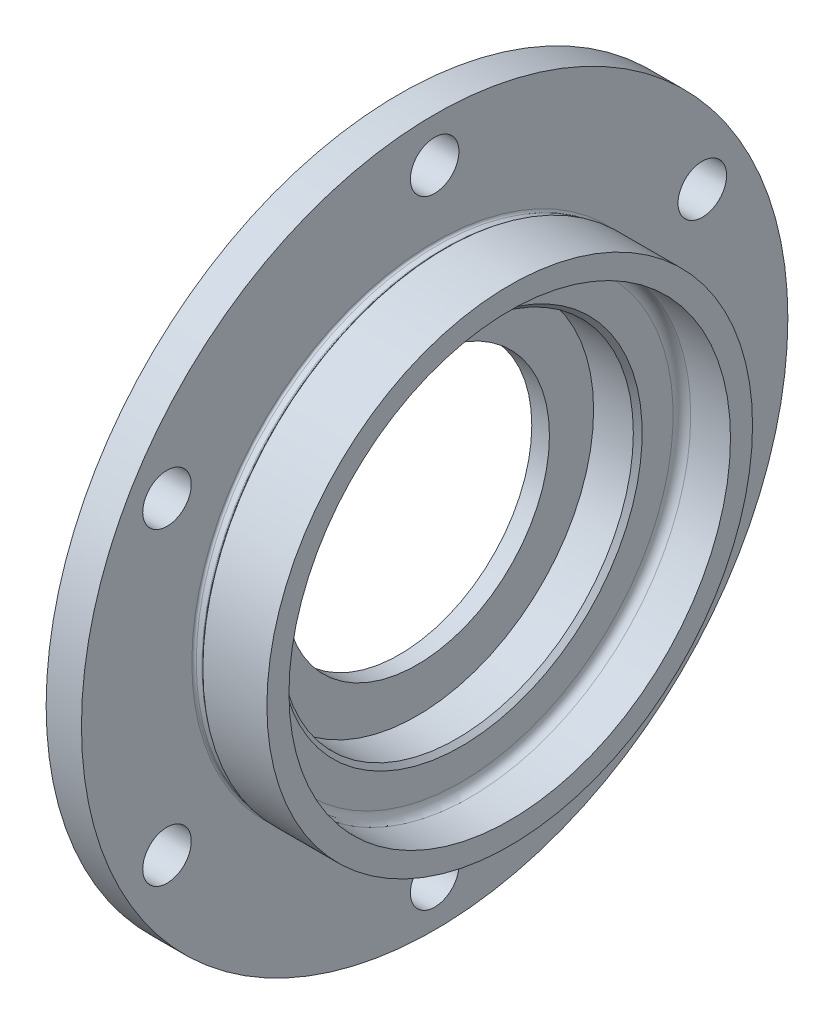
from build123d import *

# Parameters (mm, degrees)
FILLET2_R          = 0.5
CUT_EXTRUDE1_REACH = 117.866
SKETCH5_R          = 5.5
CIRPATTERN1_COUNT  = 6
CUT_EXTRUDE3_REACH = 117.866
SKETCH7_R          = 30
CHAMFER1_SIZE      = 1
FILLET3_R          = 2


with BuildPart() as part:
    # Sketch2 → Revolve1 (revolve)
    with BuildSketch(Plane.XY, mode=Mode.PRIVATE) as revolve1_sk:
        Polygon((0, 80), (0, 0), (4, 0), (4, 40), (14, 40), (14, 50), (25, 50), (25, 55), (8, 55), (8, 80), align=None)
    revolve(revolve1_sk.sketch.rotate(Axis((29.906992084, 0, 0), (-1, 0, 0)), 90), axis=Axis((29.906992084, 0, 0), (-1, 0, 0)))

    # Sketch3 → Cut-Revolve1 (revolve, cut)
    with BuildSketch(Plane.XY, mode=Mode.PRIVATE) as cut_revolve1_sk:
        Polygon((8, 55), (8, 54.5), (10, 54.5), (10.5, 55), align=None)
    revolve(cut_revolve1_sk.sketch.rotate(Axis((36.050630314, 0, 0), (-1, 0, 0)), 90), axis=Axis((36.050630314, 0, 0), (-1, 0, 0)), mode=Mode.SUBTRACT)

    # Fillet2
    fillet2_edges = [part.edges().sort_by_distance(p)[0] for p in [
        (8, 0, 54.5),
        (10, 0, 54.5),
    ]]
    fillet(fillet2_edges, radius=FILLET2_R)

    # Sketch5 → Cut-Extrude1 (cut, up to next)
    with BuildSketch(Plane.ZY, mode=Mode.PRIVATE) as cut_extrude1_sk1:
        with Locations((0, 70)):
            Circle(SKETCH5_R)
    cut_extrude1_tool1 = extrude(cut_extrude1_sk1.sketch, amount=-CUT_EXTRUDE1_REACH, mode=Mode.PRIVATE) & part.part
    cut_extrude1 = cut_extrude1_tool1.solids().sort_by_distance((0, 70, 0))[0]
    add(cut_extrude1, mode=Mode.SUBTRACT)

    # CirPattern1: Cut-Extrude1 ×6 about axis
    cirpattern1_axis = Axis((0, 0, 0), (1, 0, 0))
    for i in range(1, CIRPATTERN1_COUNT):
        add(cut_extrude1.rotate(cirpattern1_axis, i * 360 / CIRPATTERN1_COUNT), mode=Mode.SUBTRACT)

    # Sketch7 → Cut-Extrude3 (cut, up to next)
    with BuildSketch(Plane.ZY, mode=Mode.PRIVATE) as cut_extrude3_sk1:
        Circle(SKETCH7_R)
    cut_extrude3_tool1 = extrude(cut_extrude3_sk1.sketch, amount=-CUT_EXTRUDE3_REACH, mode=Mode.PRIVATE) & part.part
    add(cut_extrude3_tool1.solids().sort_by_distance((0, 0, 0))[0], mode=Mode.SUBTRACT)

    # Chamfer1
    chamfer1_edges = [part.edges().sort_by_distance(p)[0] for p in [
        (14, 0, 40),
    ]]
    chamfer(chamfer1_edges, length=CHAMFER1_SIZE)

    # Fillet3
    fillet3_edges = [part.edges().sort_by_distance(p)[0] for p in [
        (14, 0, 50),
    ]]
    fillet(fillet3_edges, radius=FILLET3_R)


solid = part.part
